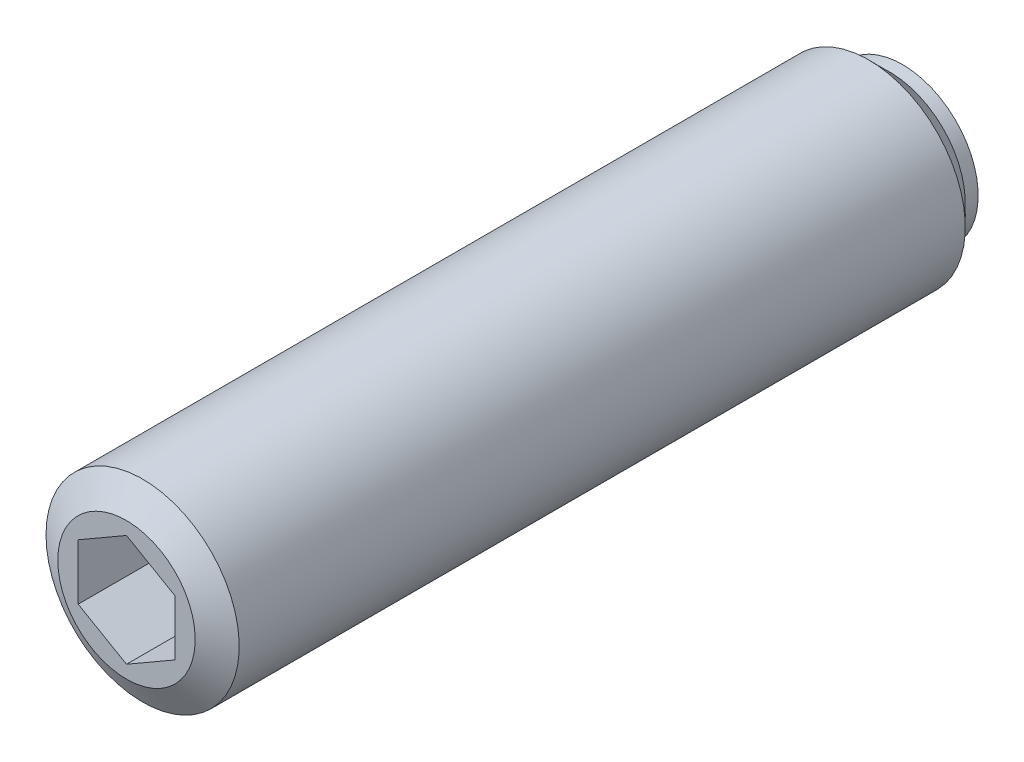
ISO-10303-21;
HEADER;
FILE_DESCRIPTION(('STEP AP214'),'2;1');
FILE_NAME('part.step','',(''),(''),'','','');
FILE_SCHEMA(('AUTOMOTIVE_DESIGN { 1 0 10303 214 1 1 1 1 }'));
ENDSEC;
DATA;
#1=APPLICATION_CONTEXT('core data for automotive mechanical design processes');
#2=APPLICATION_PROTOCOL_DEFINITION('international standard','automotive_design',2000,#1);
#3=PRODUCT_CONTEXT('',#1,'mechanical');
#4=PRODUCT('Part','Part','',(#3));
#5=PRODUCT_RELATED_PRODUCT_CATEGORY('part','',(#4));
#6=PRODUCT_DEFINITION_FORMATION('','',#4);
#7=PRODUCT_DEFINITION_CONTEXT('part definition',#1,'design');
#8=PRODUCT_DEFINITION('design','',#6,#7);
#9=PRODUCT_DEFINITION_SHAPE('','',#8);
#10=(LENGTH_UNIT() NAMED_UNIT(*) SI_UNIT(.MILLI.,.METRE.));
#11=(NAMED_UNIT(*) PLANE_ANGLE_UNIT() SI_UNIT($,.RADIAN.));
#12=(NAMED_UNIT(*) SI_UNIT($,.STERADIAN.) SOLID_ANGLE_UNIT());
#13=UNCERTAINTY_MEASURE_WITH_UNIT(LENGTH_MEASURE(1.E-05),#10,'distance_accuracy_value','');
#14=(GEOMETRIC_REPRESENTATION_CONTEXT(3) GLOBAL_UNCERTAINTY_ASSIGNED_CONTEXT((#13)) GLOBAL_UNIT_ASSIGNED_CONTEXT((#10,
#11,#12)) REPRESENTATION_CONTEXT('',''));
#15=CARTESIAN_POINT('',(0.,0.,0.));
#16=DIRECTION('',(0.,0.,1.));
#17=DIRECTION('',(1.,0.,0.));
#18=AXIS2_PLACEMENT_3D('',#15,#16,#17);
#19=CARTESIAN_POINT('',(0.,0.,2.));
#20=DIRECTION('',(0.,0.,1.));
#21=DIRECTION('',(0.,-1.,0.));
#22=AXIS2_PLACEMENT_3D('',#19,#20,#21);
#23=SPHERICAL_SURFACE('',#22,2.);
#24=CARTESIAN_POINT('',(0.,0.,0.9));
#25=DIRECTION('',(0.,0.,1.));
#26=DIRECTION('',(-1.,0.,0.));
#27=AXIS2_PLACEMENT_3D('',#24,#25,#26);
#28=CIRCLE('',#27,1.670329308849);
#29=CARTESIAN_POINT('',(-1.670329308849,0.,0.9));
#30=VERTEX_POINT('',#29);
#31=EDGE_CURVE('E9',#30,#30,#28,.T.);
#32=ORIENTED_EDGE('',*,*,#31,.F.);
#33=EDGE_LOOP('',(#32));
#34=FACE_BOUND('',#33,.T.);
#35=ADVANCED_FACE('F14',(#34),#23,.T.);
#36=CARTESIAN_POINT('',(0.,2.35,0.9));
#37=DIRECTION('',(0.,0.,1.));
#38=DIRECTION('',(-1.,0.,0.));
#39=AXIS2_PLACEMENT_3D('',#36,#37,#38);
#40=PLANE('',#39);
#41=CARTESIAN_POINT('',(0.,0.,0.9));
#42=DIRECTION('',(0.,0.,1.));
#43=DIRECTION('',(-1.,0.,0.));
#44=AXIS2_PLACEMENT_3D('',#41,#42,#43);
#45=CIRCLE('',#44,2.35);
#46=CARTESIAN_POINT('',(-2.35,0.,0.9));
#47=VERTEX_POINT('',#46);
#48=EDGE_CURVE('E21',#47,#47,#45,.T.);
#49=ORIENTED_EDGE('',*,*,#48,.F.);
#50=EDGE_LOOP('',(#49));
#51=FACE_BOUND('',#50,.T.);
#52=ORIENTED_EDGE('',*,*,#31,.T.);
#53=EDGE_LOOP('',(#52));
#54=FACE_BOUND('',#53,.T.);
#55=ADVANCED_FACE('F138',(#51,#54),#40,.F.);
#56=CARTESIAN_POINT('',(0.,0.,26.3950749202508));
#57=DIRECTION('',(0.,0.,1.));
#58=DIRECTION('',(-1.,0.,0.));
#59=AXIS2_PLACEMENT_3D('',#56,#57,#58);
#60=CYLINDRICAL_SURFACE('',#59,2.35);
#61=CARTESIAN_POINT('',(0.,0.,1.3));
#62=DIRECTION('',(0.,0.,1.));
#63=DIRECTION('',(-1.,0.,0.));
#64=AXIS2_PLACEMENT_3D('',#61,#62,#63);
#65=CIRCLE('',#64,2.35);
#66=CARTESIAN_POINT('',(-2.35,0.,1.3));
#67=VERTEX_POINT('',#66);
#68=EDGE_CURVE('E131',#67,#67,#65,.T.);
#69=ORIENTED_EDGE('',*,*,#68,.F.);
#70=EDGE_LOOP('',(#69));
#71=FACE_BOUND('',#70,.T.);
#72=ORIENTED_EDGE('',*,*,#48,.T.);
#73=EDGE_LOOP('',(#72));
#74=FACE_BOUND('',#73,.T.);
#75=ADVANCED_FACE('F136',(#71,#74),#60,.T.);
#76=CARTESIAN_POINT('',(0.,0.,1.3));
#77=DIRECTION('',(0.,0.,1.));
#78=DIRECTION('',(-1.,0.,0.));
#79=AXIS2_PLACEMENT_3D('',#76,#77,#78);
#80=CONICAL_SURFACE('',#79,2.35,0.785398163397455);
#81=CARTESIAN_POINT('',(0.,0.,1.95));
#82=DIRECTION('',(0.,0.,1.));
#83=DIRECTION('',(-1.,0.,0.));
#84=AXIS2_PLACEMENT_3D('',#81,#82,#83);
#85=CIRCLE('',#84,3.);
#86=CARTESIAN_POINT('',(-3.,0.,1.95));
#87=VERTEX_POINT('',#86);
#88=EDGE_CURVE('E128',#87,#87,#85,.T.);
#89=ORIENTED_EDGE('',*,*,#88,.F.);
#90=EDGE_LOOP('',(#89));
#91=FACE_BOUND('',#90,.T.);
#92=ORIENTED_EDGE('',*,*,#68,.T.);
#93=EDGE_LOOP('',(#92));
#94=FACE_BOUND('',#93,.T.);
#95=ADVANCED_FACE('F161',(#91,#94),#80,.T.);
#96=CARTESIAN_POINT('',(0.,0.,26.3950749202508));
#97=DIRECTION('',(0.,0.,1.));
#98=DIRECTION('',(-1.,0.,0.));
#99=AXIS2_PLACEMENT_3D('',#96,#97,#98);
#100=CYLINDRICAL_SURFACE('',#99,3.);
#101=CARTESIAN_POINT('',(0.,0.,24.5));
#102=DIRECTION('',(0.,0.,1.));
#103=DIRECTION('',(-1.,0.,0.));
#104=AXIS2_PLACEMENT_3D('',#101,#102,#103);
#105=CIRCLE('',#104,3.);
#106=CARTESIAN_POINT('',(-3.,0.,24.5));
#107=VERTEX_POINT('',#106);
#108=EDGE_CURVE('E125',#107,#107,#105,.T.);
#109=ORIENTED_EDGE('',*,*,#108,.F.);
#110=EDGE_LOOP('',(#109));
#111=FACE_BOUND('',#110,.T.);
#112=ORIENTED_EDGE('',*,*,#88,.T.);
#113=EDGE_LOOP('',(#112));
#114=FACE_BOUND('',#113,.T.);
#115=ADVANCED_FACE('F170',(#111,#114),#100,.T.);
#116=CARTESIAN_POINT('',(0.,0.,24.5));
#117=DIRECTION('',(0.,0.,-1.));
#118=DIRECTION('',(1.,0.,0.));
#119=AXIS2_PLACEMENT_3D('',#116,#117,#118);
#120=CONICAL_SURFACE('',#119,3.,1.04719755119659);
#121=CARTESIAN_POINT('',(0.,0.,25.));
#122=DIRECTION('',(0.,0.,1.));
#123=DIRECTION('',(-1.,0.,0.));
#124=AXIS2_PLACEMENT_3D('',#121,#122,#123);
#125=CIRCLE('',#124,2.13397459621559);
#126=CARTESIAN_POINT('',(-2.13397459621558,0.,25.));
#127=VERTEX_POINT('',#126);
#128=EDGE_CURVE('E116',#127,#127,#125,.T.);
#129=ORIENTED_EDGE('',*,*,#128,.F.);
#130=EDGE_LOOP('',(#129));
#131=FACE_BOUND('',#130,.T.);
#132=ORIENTED_EDGE('',*,*,#108,.T.);
#133=EDGE_LOOP('',(#132));
#134=FACE_BOUND('',#133,.T.);
#135=ADVANCED_FACE('F179',(#131,#134),#120,.T.);
#136=CARTESIAN_POINT('',(0.,0.,25.));
#137=DIRECTION('',(0.,0.,-1.));
#138=DIRECTION('',(1.,0.,0.));
#139=AXIS2_PLACEMENT_3D('',#136,#137,#138);
#140=PLANE('',#139);
#141=DIRECTION('',(-0.866025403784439,-0.5,0.));
#142=VECTOR('',#141,1.);
#143=CARTESIAN_POINT('',(0.,1.73205080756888,25.));
#144=LINE('',#143,#142);
#145=CARTESIAN_POINT('',(0.,1.73205080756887,25.));
#146=VERTEX_POINT('',#145);
#147=CARTESIAN_POINT('',(-1.5,0.866025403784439,25.));
#148=VERTEX_POINT('',#147);
#149=EDGE_CURVE('E82',#146,#148,#144,.T.);
#150=ORIENTED_EDGE('',*,*,#149,.F.);
#151=DIRECTION('',(-0.866025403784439,0.5,0.));
#152=VECTOR('',#151,1.);
#153=CARTESIAN_POINT('',(1.5,0.866025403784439,25.));
#154=LINE('',#153,#152);
#155=CARTESIAN_POINT('',(1.5,0.866025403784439,25.));
#156=VERTEX_POINT('',#155);
#157=EDGE_CURVE('E28',#156,#146,#154,.T.);
#158=ORIENTED_EDGE('',*,*,#157,.F.);
#159=DIRECTION('',(0.,1.,0.));
#160=VECTOR('',#159,1.);
#161=CARTESIAN_POINT('',(1.5,-0.866025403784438,25.));
#162=LINE('',#161,#160);
#163=CARTESIAN_POINT('',(1.5,-0.866025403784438,25.));
#164=VERTEX_POINT('',#163);
#165=EDGE_CURVE('E98',#164,#156,#162,.T.);
#166=ORIENTED_EDGE('',*,*,#165,.F.);
#167=DIRECTION('',(0.866025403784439,0.5,0.));
#168=VECTOR('',#167,1.);
#169=CARTESIAN_POINT('',(0.,-1.73205080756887,25.));
#170=LINE('',#169,#168);
#171=CARTESIAN_POINT('',(0.,-1.73205080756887,25.));
#172=VERTEX_POINT('',#171);
#173=EDGE_CURVE('E92',#172,#164,#170,.T.);
#174=ORIENTED_EDGE('',*,*,#173,.F.);
#175=DIRECTION('',(0.866025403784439,-0.5,0.));
#176=VECTOR('',#175,1.);
#177=CARTESIAN_POINT('',(-1.5,-0.86602540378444,25.));
#178=LINE('',#177,#176);
#179=CARTESIAN_POINT('',(-1.5,-0.86602540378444,25.));
#180=VERTEX_POINT('',#179);
#181=EDGE_CURVE('E90',#180,#172,#178,.T.);
#182=ORIENTED_EDGE('',*,*,#181,.F.);
#183=DIRECTION('',(0.,-1.,0.));
#184=VECTOR('',#183,1.);
#185=CARTESIAN_POINT('',(-1.5,0.866025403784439,25.));
#186=LINE('',#185,#184);
#187=EDGE_CURVE('E71',#148,#180,#186,.T.);
#188=ORIENTED_EDGE('',*,*,#187,.F.);
#189=EDGE_LOOP('',(#150,#158,#166,#174,#182,#188));
#190=FACE_BOUND('',#189,.T.);
#191=ORIENTED_EDGE('',*,*,#128,.T.);
#192=EDGE_LOOP('',(#191));
#193=FACE_BOUND('',#192,.T.);
#194=ADVANCED_FACE('F86',(#190,#193),#140,.F.);
#195=CARTESIAN_POINT('',(1.5,0.866025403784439,22.));
#196=DIRECTION('',(0.5,0.866025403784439,0.));
#197=DIRECTION('',(0.866025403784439,-0.5,0.));
#198=AXIS2_PLACEMENT_3D('',#195,#196,#197);
#199=PLANE('',#198);
#200=ORIENTED_EDGE('',*,*,#157,.T.);
#201=DIRECTION('',(0.,0.,1.));
#202=VECTOR('',#201,1.);
#203=CARTESIAN_POINT('',(0.,1.73205080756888,22.));
#204=LINE('',#203,#202);
#205=CARTESIAN_POINT('',(0.,1.73205080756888,22.));
#206=VERTEX_POINT('',#205);
#207=EDGE_CURVE('E79',#206,#146,#204,.T.);
#208=ORIENTED_EDGE('',*,*,#207,.F.);
#209=DIRECTION('',(-0.866025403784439,0.5,0.));
#210=VECTOR('',#209,1.);
#211=CARTESIAN_POINT('',(1.5,0.866025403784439,22.));
#212=LINE('',#211,#210);
#213=CARTESIAN_POINT('',(1.5,0.866025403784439,22.));
#214=VERTEX_POINT('',#213);
#215=EDGE_CURVE('E100',#214,#206,#212,.T.);
#216=ORIENTED_EDGE('',*,*,#215,.F.);
#217=DIRECTION('',(0.,0.,1.));
#218=VECTOR('',#217,1.);
#219=CARTESIAN_POINT('',(1.5,0.866025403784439,22.));
#220=LINE('',#219,#218);
#221=EDGE_CURVE('E35',#214,#156,#220,.T.);
#222=ORIENTED_EDGE('',*,*,#221,.T.);
#223=EDGE_LOOP('',(#200,#208,#216,#222));
#224=FACE_BOUND('',#223,.T.);
#225=ADVANCED_FACE('F196',(#224),#199,.F.);
#226=CARTESIAN_POINT('',(1.5,-0.866025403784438,22.));
#227=DIRECTION('',(1.,0.,0.));
#228=DIRECTION('',(0.,-1.,0.));
#229=AXIS2_PLACEMENT_3D('',#226,#227,#228);
#230=PLANE('',#229);
#231=ORIENTED_EDGE('',*,*,#165,.T.);
#232=ORIENTED_EDGE('',*,*,#221,.F.);
#233=DIRECTION('',(0.,1.,0.));
#234=VECTOR('',#233,1.);
#235=CARTESIAN_POINT('',(1.5,-0.866025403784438,22.));
#236=LINE('',#235,#234);
#237=CARTESIAN_POINT('',(1.5,-0.866025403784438,22.));
#238=VERTEX_POINT('',#237);
#239=EDGE_CURVE('E112',#238,#214,#236,.T.);
#240=ORIENTED_EDGE('',*,*,#239,.F.);
#241=DIRECTION('',(0.,0.,1.));
#242=VECTOR('',#241,1.);
#243=CARTESIAN_POINT('',(1.5,-0.866025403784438,22.));
#244=LINE('',#243,#242);
#245=EDGE_CURVE('E117',#238,#164,#244,.T.);
#246=ORIENTED_EDGE('',*,*,#245,.T.);
#247=EDGE_LOOP('',(#231,#232,#240,#246));
#248=FACE_BOUND('',#247,.T.);
#249=ADVANCED_FACE('F204',(#248),#230,.F.);
#250=CARTESIAN_POINT('',(0.,-1.73205080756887,22.));
#251=DIRECTION('',(0.5,-0.866025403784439,0.));
#252=DIRECTION('',(-0.866025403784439,-0.5,0.));
#253=AXIS2_PLACEMENT_3D('',#250,#251,#252);
#254=PLANE('',#253);
#255=ORIENTED_EDGE('',*,*,#173,.T.);
#256=ORIENTED_EDGE('',*,*,#245,.F.);
#257=DIRECTION('',(0.866025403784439,0.5,0.));
#258=VECTOR('',#257,1.);
#259=CARTESIAN_POINT('',(0.,-1.73205080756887,22.));
#260=LINE('',#259,#258);
#261=CARTESIAN_POINT('',(0.,-1.73205080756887,22.));
#262=VERTEX_POINT('',#261);
#263=EDGE_CURVE('E109',#262,#238,#260,.T.);
#264=ORIENTED_EDGE('',*,*,#263,.F.);
#265=DIRECTION('',(0.,0.,1.));
#266=VECTOR('',#265,1.);
#267=CARTESIAN_POINT('',(0.,-1.73205080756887,22.));
#268=LINE('',#267,#266);
#269=EDGE_CURVE('E119',#262,#172,#268,.T.);
#270=ORIENTED_EDGE('',*,*,#269,.T.);
#271=EDGE_LOOP('',(#255,#256,#264,#270));
#272=FACE_BOUND('',#271,.T.);
#273=ADVANCED_FACE('F212',(#272),#254,.F.);
#274=CARTESIAN_POINT('',(-1.5,-0.86602540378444,22.));
#275=DIRECTION('',(-0.5,-0.866025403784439,0.));
#276=DIRECTION('',(-0.866025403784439,0.5,0.));
#277=AXIS2_PLACEMENT_3D('',#274,#275,#276);
#278=PLANE('',#277);
#279=ORIENTED_EDGE('',*,*,#181,.T.);
#280=ORIENTED_EDGE('',*,*,#269,.F.);
#281=DIRECTION('',(0.866025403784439,-0.5,0.));
#282=VECTOR('',#281,1.);
#283=CARTESIAN_POINT('',(-1.5,-0.86602540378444,22.));
#284=LINE('',#283,#282);
#285=CARTESIAN_POINT('',(-1.5,-0.86602540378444,22.));
#286=VERTEX_POINT('',#285);
#287=EDGE_CURVE('E106',#286,#262,#284,.T.);
#288=ORIENTED_EDGE('',*,*,#287,.F.);
#289=DIRECTION('',(0.,0.,1.));
#290=VECTOR('',#289,1.);
#291=CARTESIAN_POINT('',(-1.5,-0.86602540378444,22.));
#292=LINE('',#291,#290);
#293=EDGE_CURVE('E78',#286,#180,#292,.T.);
#294=ORIENTED_EDGE('',*,*,#293,.T.);
#295=EDGE_LOOP('',(#279,#280,#288,#294));
#296=FACE_BOUND('',#295,.T.);
#297=ADVANCED_FACE('F220',(#296),#278,.F.);
#298=CARTESIAN_POINT('',(-1.5,0.866025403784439,22.));
#299=DIRECTION('',(-1.,0.,0.));
#300=DIRECTION('',(0.,1.,0.));
#301=AXIS2_PLACEMENT_3D('',#298,#299,#300);
#302=PLANE('',#301);
#303=ORIENTED_EDGE('',*,*,#187,.T.);
#304=ORIENTED_EDGE('',*,*,#293,.F.);
#305=DIRECTION('',(0.,-1.,0.));
#306=VECTOR('',#305,1.);
#307=CARTESIAN_POINT('',(-1.5,0.866025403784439,22.));
#308=LINE('',#307,#306);
#309=CARTESIAN_POINT('',(-1.5,0.866025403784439,22.));
#310=VERTEX_POINT('',#309);
#311=EDGE_CURVE('E74',#310,#286,#308,.T.);
#312=ORIENTED_EDGE('',*,*,#311,.F.);
#313=DIRECTION('',(0.,0.,1.));
#314=VECTOR('',#313,1.);
#315=CARTESIAN_POINT('',(-1.5,0.866025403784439,22.));
#316=LINE('',#315,#314);
#317=EDGE_CURVE('E67',#310,#148,#316,.T.);
#318=ORIENTED_EDGE('',*,*,#317,.T.);
#319=EDGE_LOOP('',(#303,#304,#312,#318));
#320=FACE_BOUND('',#319,.T.);
#321=ADVANCED_FACE('F69',(#320),#302,.F.);
#322=CARTESIAN_POINT('',(0.,1.73205080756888,22.));
#323=DIRECTION('',(-0.5,0.866025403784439,0.));
#324=DIRECTION('',(0.866025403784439,0.5,0.));
#325=AXIS2_PLACEMENT_3D('',#322,#323,#324);
#326=PLANE('',#325);
#327=ORIENTED_EDGE('',*,*,#149,.T.);
#328=ORIENTED_EDGE('',*,*,#317,.F.);
#329=DIRECTION('',(-0.866025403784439,-0.5,0.));
#330=VECTOR('',#329,1.);
#331=CARTESIAN_POINT('',(0.,1.73205080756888,22.));
#332=LINE('',#331,#330);
#333=EDGE_CURVE('E103',#206,#310,#332,.T.);
#334=ORIENTED_EDGE('',*,*,#333,.F.);
#335=ORIENTED_EDGE('',*,*,#207,.T.);
#336=EDGE_LOOP('',(#327,#328,#334,#335));
#337=FACE_BOUND('',#336,.T.);
#338=ADVANCED_FACE('F83',(#337),#326,.F.);
#339=CARTESIAN_POINT('',(3.,0.,22.));
#340=DIRECTION('',(0.,0.,-1.));
#341=DIRECTION('',(1.,0.,0.));
#342=AXIS2_PLACEMENT_3D('',#339,#340,#341);
#343=PLANE('',#342);
#344=ORIENTED_EDGE('',*,*,#215,.T.);
#345=ORIENTED_EDGE('',*,*,#333,.T.);
#346=ORIENTED_EDGE('',*,*,#311,.T.);
#347=ORIENTED_EDGE('',*,*,#287,.T.);
#348=ORIENTED_EDGE('',*,*,#263,.T.);
#349=ORIENTED_EDGE('',*,*,#239,.T.);
#350=EDGE_LOOP('',(#344,#345,#346,#347,#348,#349));
#351=FACE_BOUND('',#350,.T.);
#352=ADVANCED_FACE('F244',(#351),#343,.F.);
#353=CLOSED_SHELL('',(#35,#55,#75,#95,#115,#135,#194,#225,#249,#273,#297,#321,#338,#352));
#354=MANIFOLD_SOLID_BREP('B1',#353);
#355=ADVANCED_BREP_SHAPE_REPRESENTATION('',(#18,#354),#14);
#356=SHAPE_DEFINITION_REPRESENTATION(#9,#355);
ENDSEC;
END-ISO-10303-21;
